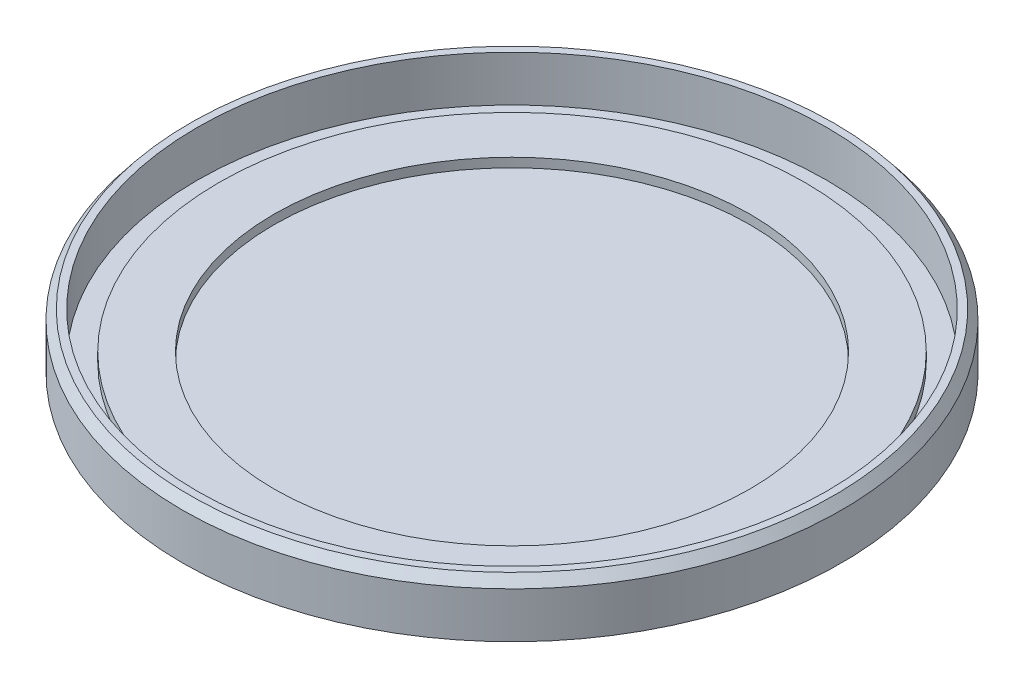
ISO-10303-21;
HEADER;
FILE_DESCRIPTION(('STEP AP214'),'2;1');
FILE_NAME('part.step','',(''),(''),'','','');
FILE_SCHEMA(('AUTOMOTIVE_DESIGN { 1 0 10303 214 1 1 1 1 }'));
ENDSEC;
DATA;
#1=APPLICATION_CONTEXT('core data for automotive mechanical design processes');
#2=APPLICATION_PROTOCOL_DEFINITION('international standard','automotive_design',2000,#1);
#3=PRODUCT_CONTEXT('',#1,'mechanical');
#4=PRODUCT('Part','Part','',(#3));
#5=PRODUCT_RELATED_PRODUCT_CATEGORY('part','',(#4));
#6=PRODUCT_DEFINITION_FORMATION('','',#4);
#7=PRODUCT_DEFINITION_CONTEXT('part definition',#1,'design');
#8=PRODUCT_DEFINITION('design','',#6,#7);
#9=PRODUCT_DEFINITION_SHAPE('','',#8);
#10=(LENGTH_UNIT() NAMED_UNIT(*) SI_UNIT(.MILLI.,.METRE.));
#11=(NAMED_UNIT(*) PLANE_ANGLE_UNIT() SI_UNIT($,.RADIAN.));
#12=(NAMED_UNIT(*) SI_UNIT($,.STERADIAN.) SOLID_ANGLE_UNIT());
#13=UNCERTAINTY_MEASURE_WITH_UNIT(LENGTH_MEASURE(1.E-05),#10,'distance_accuracy_value','');
#14=(GEOMETRIC_REPRESENTATION_CONTEXT(3) GLOBAL_UNCERTAINTY_ASSIGNED_CONTEXT((#13)) GLOBAL_UNIT_ASSIGNED_CONTEXT((#10,
#11,#12)) REPRESENTATION_CONTEXT('',''));
#15=CARTESIAN_POINT('',(0.,0.,0.));
#16=DIRECTION('',(0.,0.,1.));
#17=DIRECTION('',(1.,0.,0.));
#18=AXIS2_PLACEMENT_3D('',#15,#16,#17);
#19=CARTESIAN_POINT('',(0.,0.,0.));
#20=DIRECTION('',(0.,-1.,0.));
#21=DIRECTION('',(0.,0.,-1.));
#22=AXIS2_PLACEMENT_3D('',#19,#20,#21);
#23=PLANE('',#22);
#24=CARTESIAN_POINT('',(0.,0.,0.));
#25=DIRECTION('',(0.,-1.,0.));
#26=DIRECTION('',(0.,0.,-1.));
#27=AXIS2_PLACEMENT_3D('',#24,#25,#26);
#28=CIRCLE('',#27,180.);
#29=CARTESIAN_POINT('',(0.,0.,-180.));
#30=VERTEX_POINT('',#29);
#31=EDGE_CURVE('E10',#30,#30,#28,.T.);
#32=ORIENTED_EDGE('',*,*,#31,.T.);
#33=EDGE_LOOP('',(#32));
#34=FACE_BOUND('',#33,.T.);
#35=ADVANCED_FACE('F40',(#34),#23,.T.);
#36=CARTESIAN_POINT('',(0.,-10.,0.));
#37=DIRECTION('',(0.,-1.,0.));
#38=DIRECTION('',(0.,0.,-1.));
#39=AXIS2_PLACEMENT_3D('',#36,#37,#38);
#40=CYLINDRICAL_SURFACE('',#39,180.);
#41=CARTESIAN_POINT('',(0.,25.,0.));
#42=DIRECTION('',(0.,-1.,0.));
#43=DIRECTION('',(0.,0.,-1.));
#44=AXIS2_PLACEMENT_3D('',#41,#42,#43);
#45=CIRCLE('',#44,180.);
#46=CARTESIAN_POINT('',(0.,25.,-180.));
#47=VERTEX_POINT('',#46);
#48=EDGE_CURVE('E43',#47,#47,#45,.T.);
#49=ORIENTED_EDGE('',*,*,#48,.T.);
#50=EDGE_LOOP('',(#49));
#51=FACE_BOUND('',#50,.T.);
#52=ORIENTED_EDGE('',*,*,#31,.F.);
#53=EDGE_LOOP('',(#52));
#54=FACE_BOUND('',#53,.T.);
#55=ADVANCED_FACE('F84',(#51,#54),#40,.T.);
#56=CARTESIAN_POINT('',(0.,25.,0.));
#57=DIRECTION('',(0.,-1.,0.));
#58=DIRECTION('',(0.,0.,-1.));
#59=AXIS2_PLACEMENT_3D('',#56,#57,#58);
#60=CONICAL_SURFACE('',#59,180.,0.674740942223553);
#61=CARTESIAN_POINT('',(0.,30.,0.));
#62=DIRECTION('',(0.,-1.,0.));
#63=DIRECTION('',(0.,0.,-1.));
#64=AXIS2_PLACEMENT_3D('',#61,#62,#63);
#65=CIRCLE('',#64,176.);
#66=CARTESIAN_POINT('',(0.,30.,-176.));
#67=VERTEX_POINT('',#66);
#68=EDGE_CURVE('E50',#67,#67,#65,.T.);
#69=ORIENTED_EDGE('',*,*,#68,.T.);
#70=EDGE_LOOP('',(#69));
#71=FACE_BOUND('',#70,.T.);
#72=ORIENTED_EDGE('',*,*,#48,.F.);
#73=EDGE_LOOP('',(#72));
#74=FACE_BOUND('',#73,.T.);
#75=ADVANCED_FACE('F88',(#71,#74),#60,.T.);
#76=CARTESIAN_POINT('',(176.,30.,0.));
#77=DIRECTION('',(0.,1.,0.));
#78=DIRECTION('',(0.,0.,1.));
#79=AXIS2_PLACEMENT_3D('',#76,#77,#78);
#80=PLANE('',#79);
#81=CARTESIAN_POINT('',(0.,30.,0.));
#82=DIRECTION('',(0.,-1.,0.));
#83=DIRECTION('',(0.,0.,-1.));
#84=AXIS2_PLACEMENT_3D('',#81,#82,#83);
#85=CIRCLE('',#84,172.);
#86=CARTESIAN_POINT('',(0.,30.,-172.));
#87=VERTEX_POINT('',#86);
#88=EDGE_CURVE('E51',#87,#87,#85,.T.);
#89=ORIENTED_EDGE('',*,*,#88,.T.);
#90=EDGE_LOOP('',(#89));
#91=FACE_BOUND('',#90,.T.);
#92=ORIENTED_EDGE('',*,*,#68,.F.);
#93=EDGE_LOOP('',(#92));
#94=FACE_BOUND('',#93,.T.);
#95=ADVANCED_FACE('F95',(#91,#94),#80,.T.);
#96=CARTESIAN_POINT('',(0.,-10.,0.));
#97=DIRECTION('',(0.,-1.,0.));
#98=DIRECTION('',(0.,0.,-1.));
#99=AXIS2_PLACEMENT_3D('',#96,#97,#98);
#100=CYLINDRICAL_SURFACE('',#99,172.);
#101=CARTESIAN_POINT('',(0.,5.,0.));
#102=DIRECTION('',(0.,-1.,0.));
#103=DIRECTION('',(0.,0.,-1.));
#104=AXIS2_PLACEMENT_3D('',#101,#102,#103);
#105=CIRCLE('',#104,172.);
#106=CARTESIAN_POINT('',(0.,5.,-172.));
#107=VERTEX_POINT('',#106);
#108=EDGE_CURVE('E57',#107,#107,#105,.T.);
#109=ORIENTED_EDGE('',*,*,#108,.T.);
#110=EDGE_LOOP('',(#109));
#111=FACE_BOUND('',#110,.T.);
#112=ORIENTED_EDGE('',*,*,#88,.F.);
#113=EDGE_LOOP('',(#112));
#114=FACE_BOUND('',#113,.T.);
#115=ADVANCED_FACE('F98',(#111,#114),#100,.F.);
#116=CARTESIAN_POINT('',(172.,5.,0.));
#117=DIRECTION('',(0.,1.,0.));
#118=DIRECTION('',(0.,0.,1.));
#119=AXIS2_PLACEMENT_3D('',#116,#117,#118);
#120=PLANE('',#119);
#121=CARTESIAN_POINT('',(0.,5.,0.));
#122=DIRECTION('',(0.,-1.,0.));
#123=DIRECTION('',(0.,0.,-1.));
#124=AXIS2_PLACEMENT_3D('',#121,#122,#123);
#125=CIRCLE('',#124,160.);
#126=CARTESIAN_POINT('',(0.,5.,-160.));
#127=VERTEX_POINT('',#126);
#128=EDGE_CURVE('E56',#127,#127,#125,.T.);
#129=ORIENTED_EDGE('',*,*,#128,.T.);
#130=EDGE_LOOP('',(#129));
#131=FACE_BOUND('',#130,.T.);
#132=ORIENTED_EDGE('',*,*,#108,.F.);
#133=EDGE_LOOP('',(#132));
#134=FACE_BOUND('',#133,.T.);
#135=ADVANCED_FACE('F104',(#131,#134),#120,.T.);
#136=CARTESIAN_POINT('',(0.,-10.,0.));
#137=DIRECTION('',(0.,-1.,0.));
#138=DIRECTION('',(0.,0.,-1.));
#139=AXIS2_PLACEMENT_3D('',#136,#137,#138);
#140=CYLINDRICAL_SURFACE('',#139,160.);
#141=CARTESIAN_POINT('',(0.,10.,0.));
#142=DIRECTION('',(0.,-1.,0.));
#143=DIRECTION('',(0.,0.,-1.));
#144=AXIS2_PLACEMENT_3D('',#141,#142,#143);
#145=CIRCLE('',#144,160.);
#146=CARTESIAN_POINT('',(0.,10.,-160.));
#147=VERTEX_POINT('',#146);
#148=EDGE_CURVE('E62',#147,#147,#145,.T.);
#149=ORIENTED_EDGE('',*,*,#148,.T.);
#150=EDGE_LOOP('',(#149));
#151=FACE_BOUND('',#150,.T.);
#152=ORIENTED_EDGE('',*,*,#128,.F.);
#153=EDGE_LOOP('',(#152));
#154=FACE_BOUND('',#153,.T.);
#155=ADVANCED_FACE('F107',(#151,#154),#140,.T.);
#156=CARTESIAN_POINT('',(160.,10.,0.));
#157=DIRECTION('',(0.,1.,0.));
#158=DIRECTION('',(0.,0.,1.));
#159=AXIS2_PLACEMENT_3D('',#156,#157,#158);
#160=PLANE('',#159);
#161=CARTESIAN_POINT('',(0.,10.,0.));
#162=DIRECTION('',(0.,-1.,0.));
#163=DIRECTION('',(0.,0.,-1.));
#164=AXIS2_PLACEMENT_3D('',#161,#162,#163);
#165=CIRCLE('',#164,130.);
#166=CARTESIAN_POINT('',(0.,10.,-130.));
#167=VERTEX_POINT('',#166);
#168=EDGE_CURVE('E65',#167,#167,#165,.T.);
#169=ORIENTED_EDGE('',*,*,#168,.T.);
#170=EDGE_LOOP('',(#169));
#171=FACE_BOUND('',#170,.T.);
#172=ORIENTED_EDGE('',*,*,#148,.F.);
#173=EDGE_LOOP('',(#172));
#174=FACE_BOUND('',#173,.T.);
#175=ADVANCED_FACE('F83',(#171,#174),#160,.T.);
#176=CARTESIAN_POINT('',(0.,-10.,0.));
#177=DIRECTION('',(0.,-1.,0.));
#178=DIRECTION('',(0.,0.,-1.));
#179=AXIS2_PLACEMENT_3D('',#176,#177,#178);
#180=CYLINDRICAL_SURFACE('',#179,130.);
#181=CARTESIAN_POINT('',(0.,5.,0.));
#182=DIRECTION('',(0.,-1.,0.));
#183=DIRECTION('',(0.,0.,-1.));
#184=AXIS2_PLACEMENT_3D('',#181,#182,#183);
#185=CIRCLE('',#184,130.);
#186=CARTESIAN_POINT('',(0.,5.,-130.));
#187=VERTEX_POINT('',#186);
#188=EDGE_CURVE('E66',#187,#187,#185,.T.);
#189=ORIENTED_EDGE('',*,*,#188,.T.);
#190=EDGE_LOOP('',(#189));
#191=FACE_BOUND('',#190,.T.);
#192=ORIENTED_EDGE('',*,*,#168,.F.);
#193=EDGE_LOOP('',(#192));
#194=FACE_BOUND('',#193,.T.);
#195=ADVANCED_FACE('F72',(#191,#194),#180,.F.);
#196=CARTESIAN_POINT('',(130.,5.,0.));
#197=DIRECTION('',(0.,1.,0.));
#198=DIRECTION('',(0.,0.,1.));
#199=AXIS2_PLACEMENT_3D('',#196,#197,#198);
#200=PLANE('',#199);
#201=ORIENTED_EDGE('',*,*,#188,.F.);
#202=EDGE_LOOP('',(#201));
#203=FACE_BOUND('',#202,.T.);
#204=ADVANCED_FACE('F75',(#203),#200,.T.);
#205=CLOSED_SHELL('',(#35,#55,#75,#95,#115,#135,#155,#175,#195,#204));
#206=MANIFOLD_SOLID_BREP('B2',#205);
#207=ADVANCED_BREP_SHAPE_REPRESENTATION('',(#18,#206),#14);
#208=SHAPE_DEFINITION_REPRESENTATION(#9,#207);
ENDSEC;
END-ISO-10303-21;
